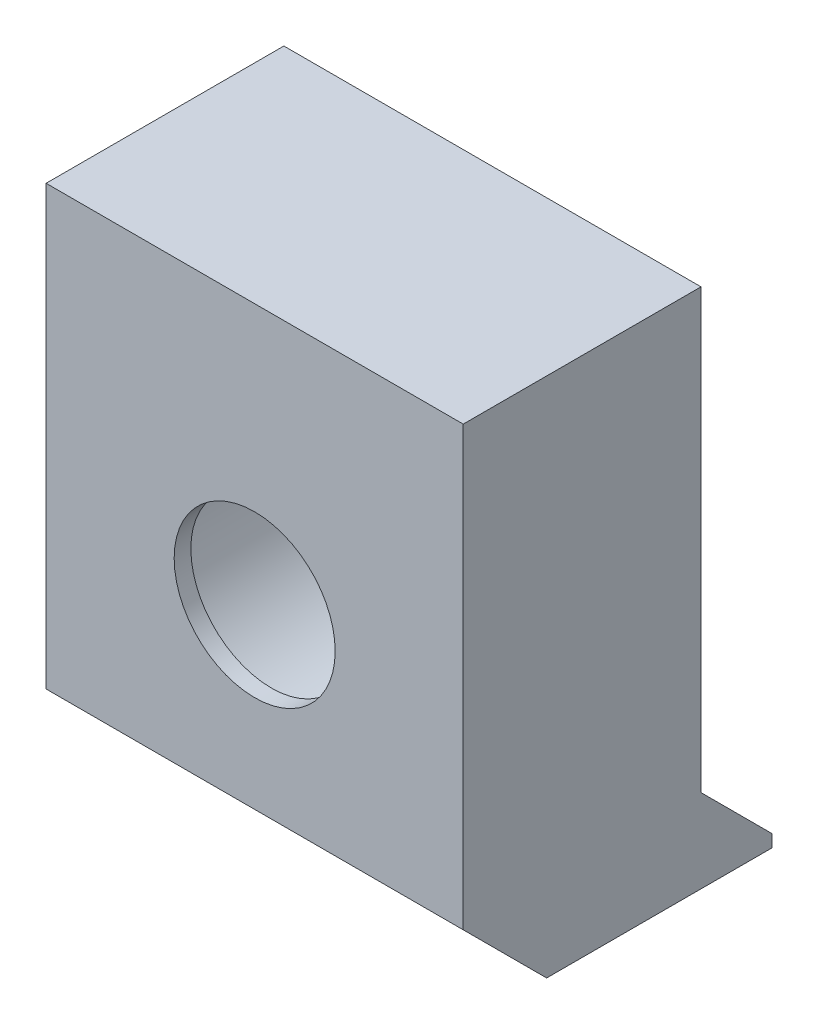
from build123d import *

# Parameters (mm, degrees)
SKETCH1_W           = 25.4
SKETCH1_H           = 31.75
EXTRUDE1_DEPTH      = 14.478
EXTRUDE6_DEPTH      = 25.4
SKETCH10_R          = 4.9022
EXTRUDE8_DEPTH      = 29.210299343
SKETCH9_R           = 7.92988
EXTRUDE7_BORE_DEPTH = 13.462
CUT_EXTRUDE1_DEPTH  = 34.268425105
CHAMFER1_SIZE       = 5.08
SKETCH16_R          = 7.9502
CUT_EXTRUDE2_DEPTH  = 2.54


with BuildPart() as part:
    # Sketch1 → Extrude1 (new body)
    with BuildSketch(Plane.XY):
        Rectangle(SKETCH1_W, SKETCH1_H)
    extrude(amount=EXTRUDE1_DEPTH)

    # Sketch8 → Extrude6 (add)
    with BuildSketch(Plane.ZY.offset(12.7)):
        Polygon((0, -10.795), (-5.08, -15.875), (0, -15.875), align=None)
    extrude(amount=-EXTRUDE6_DEPTH)

    # Sketch10 → Extrude8 (cut, through all)
    with BuildSketch(Plane(origin=(0, 0, 14.478), x_dir=(-1, 0, 0), z_dir=(0, 0, -1))):
        Circle(SKETCH10_R)
    extrude(amount=EXTRUDE8_DEPTH, mode=Mode.SUBTRACT)

    # Sketch9 → Extrude7 BORE (cut)
    with BuildSketch(Plane.XY):
        with Locations(Location((0, 0, 0), (0, 0, 180))):
            Circle(SKETCH9_R)
    extrude(amount=EXTRUDE7_BORE_DEPTH, mode=Mode.SUBTRACT)

    # Sketch12 → Cut-Extrude1 (cut, through all)
    with BuildSketch(Plane(origin=(12.7, 0, 0), x_dir=(0, 0, -1), z_dir=(1, 0, 0))):
        Polygon((5.08, -15.875), (4.318, -15.875), (4.318, -15.113), align=None)
    extrude(amount=-CUT_EXTRUDE1_DEPTH, mode=Mode.SUBTRACT)

    # Chamfer1
    chamfer1_edges = [part.edges().sort_by_distance(p)[0] for p in [
        (0, -15.875, 14.478),
    ]]
    chamfer(chamfer1_edges, length=CHAMFER1_SIZE)

    # Sketch16 → Cut-Extrude2 (cut)
    with BuildSketch(Plane(origin=(0, 0, 0), x_dir=(-1, 0, 0), z_dir=(0, 0, -1))):
        Circle(SKETCH16_R)
    extrude(amount=-CUT_EXTRUDE2_DEPTH, mode=Mode.SUBTRACT)


solid = part.part
